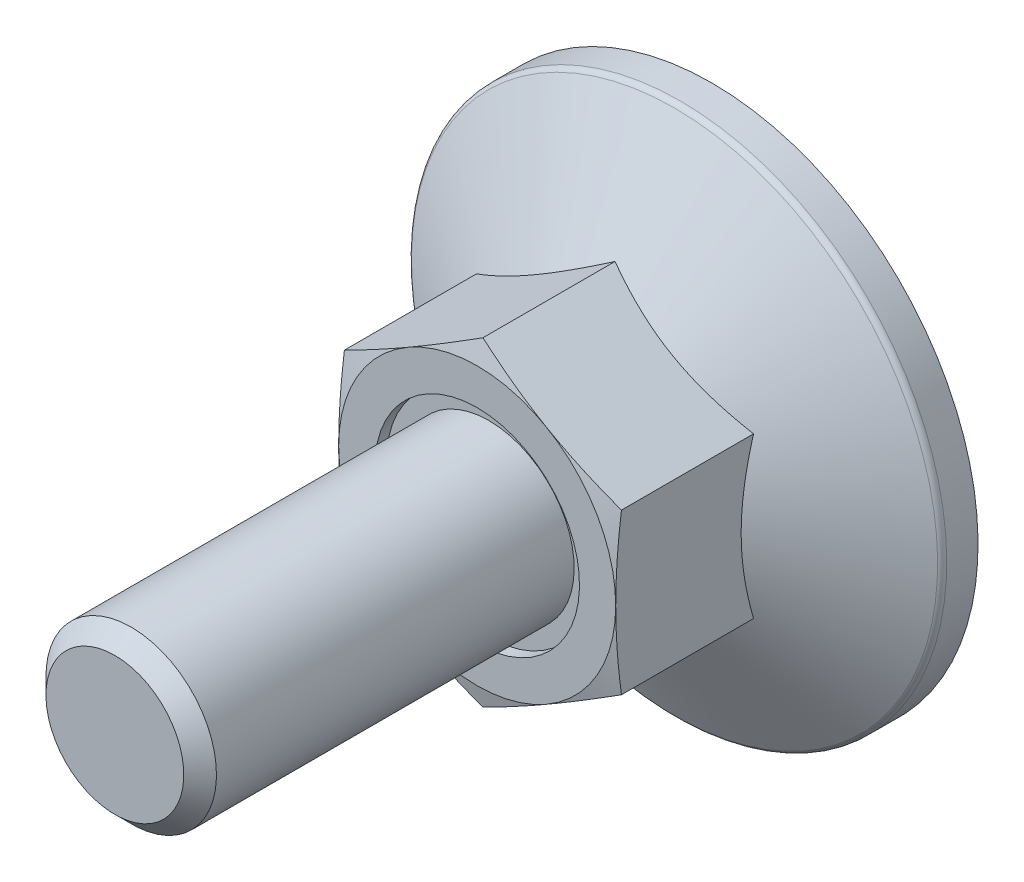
ISO-10303-21;
HEADER;
FILE_DESCRIPTION(('STEP AP214'),'2;1');
FILE_NAME('part.step','',(''),(''),'','','');
FILE_SCHEMA(('AUTOMOTIVE_DESIGN { 1 0 10303 214 1 1 1 1 }'));
ENDSEC;
DATA;
#1=APPLICATION_CONTEXT('core data for automotive mechanical design processes');
#2=APPLICATION_PROTOCOL_DEFINITION('international standard','automotive_design',2000,#1);
#3=PRODUCT_CONTEXT('',#1,'mechanical');
#4=PRODUCT('Part','Part','',(#3));
#5=PRODUCT_RELATED_PRODUCT_CATEGORY('part','',(#4));
#6=PRODUCT_DEFINITION_FORMATION('','',#4);
#7=PRODUCT_DEFINITION_CONTEXT('part definition',#1,'design');
#8=PRODUCT_DEFINITION('design','',#6,#7);
#9=PRODUCT_DEFINITION_SHAPE('','',#8);
#10=(LENGTH_UNIT() NAMED_UNIT(*) SI_UNIT(.MILLI.,.METRE.));
#11=(NAMED_UNIT(*) PLANE_ANGLE_UNIT() SI_UNIT($,.RADIAN.));
#12=(NAMED_UNIT(*) SI_UNIT($,.STERADIAN.) SOLID_ANGLE_UNIT());
#13=UNCERTAINTY_MEASURE_WITH_UNIT(LENGTH_MEASURE(1.E-05),#10,'distance_accuracy_value','');
#14=(GEOMETRIC_REPRESENTATION_CONTEXT(3) GLOBAL_UNCERTAINTY_ASSIGNED_CONTEXT((#13)) GLOBAL_UNIT_ASSIGNED_CONTEXT((#10,
#11,#12)) REPRESENTATION_CONTEXT('',''));
#15=CARTESIAN_POINT('',(0.,0.,0.));
#16=DIRECTION('',(0.,0.,1.));
#17=DIRECTION('',(1.,0.,0.));
#18=AXIS2_PLACEMENT_3D('',#15,#16,#17);
#19=CARTESIAN_POINT('',(0.,0.,10.45));
#20=DIRECTION('',(0.,0.,-1.));
#21=DIRECTION('',(0.,1.,0.));
#22=AXIS2_PLACEMENT_3D('',#19,#20,#21);
#23=PLANE('',#22);
#24=CARTESIAN_POINT('',(0.,0.,10.45));
#25=DIRECTION('',(0.,0.,-1.));
#26=DIRECTION('',(0.,1.,0.));
#27=AXIS2_PLACEMENT_3D('',#24,#25,#26);
#28=CIRCLE('',#27,4.8);
#29=CARTESIAN_POINT('',(0.,4.8,10.45));
#30=VERTEX_POINT('',#29);
#31=EDGE_CURVE('E27',#30,#30,#28,.T.);
#32=ORIENTED_EDGE('',*,*,#31,.F.);
#33=EDGE_LOOP('',(#32));
#34=FACE_BOUND('',#33,.T.);
#35=CARTESIAN_POINT('',(0.,0.,10.45));
#36=DIRECTION('',(0.,0.,-1.));
#37=DIRECTION('',(0.,1.,0.));
#38=AXIS2_PLACEMENT_3D('',#35,#36,#37);
#39=CIRCLE('',#38,4.);
#40=CARTESIAN_POINT('',(0.,4.,10.45));
#41=VERTEX_POINT('',#40);
#42=EDGE_CURVE('E252',#41,#41,#39,.F.);
#43=ORIENTED_EDGE('',*,*,#42,.F.);
#44=EDGE_LOOP('',(#43));
#45=FACE_BOUND('',#44,.T.);
#46=ADVANCED_FACE('F14',(#34,#45),#23,.F.);
#47=CARTESIAN_POINT('',(0.,7.5055534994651,22.));
#48=DIRECTION('',(0.499999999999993,-0.866025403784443,0.));
#49=DIRECTION('',(0.866025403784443,0.499999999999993,0.));
#50=AXIS2_PLACEMENT_3D('',#47,#48,#49);
#51=PLANE('',#50);
#52=CARTESIAN_POINT('',(-6.5002,3.75266127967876,4.53347836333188));
#53=CARTESIAN_POINT('',(-6.35732254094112,3.83515161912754,4.58109719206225));
#54=CARTESIAN_POINT('',(-6.21391236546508,3.91794952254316,4.62655491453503));
#55=CARTESIAN_POINT('',(-5.9259273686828,4.08421773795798,4.71255293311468));
#56=CARTESIAN_POINT('',(-5.78135207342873,4.16768832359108,4.7530911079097));
#57=CARTESIAN_POINT('',(-5.34531134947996,4.41943655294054,4.86653061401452));
#58=CARTESIAN_POINT('',(-5.05212471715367,4.58870793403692,4.93105380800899));
#59=CARTESIAN_POINT('',(-4.61337625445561,4.84201947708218,5.00671503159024));
#60=CARTESIAN_POINT('',(-4.46912536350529,4.92530276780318,5.02826875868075));
#61=CARTESIAN_POINT('',(-4.17997178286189,5.09224566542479,5.06441130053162));
#62=CARTESIAN_POINT('',(-4.03506915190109,5.17590523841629,5.07900073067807));
#63=CARTESIAN_POINT('',(-3.74501222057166,5.34336968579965,5.10084286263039));
#64=CARTESIAN_POINT('',(-3.59985839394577,5.42717428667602,5.10810389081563));
#65=CARTESIAN_POINT('',(-3.30942466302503,5.59485627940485,5.11514131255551));
#66=CARTESIAN_POINT('',(-3.16414476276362,5.67873366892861,5.11491793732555));
#67=CARTESIAN_POINT('',(-2.76612405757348,5.90853103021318,5.1040181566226));
#68=CARTESIAN_POINT('',(-2.51351353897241,6.05437578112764,5.08571979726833));
#69=CARTESIAN_POINT('',(-2.00997032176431,6.34509659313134,5.02769527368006));
#70=CARTESIAN_POINT('',(-1.75903939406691,6.48997163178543,4.9879492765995));
#71=CARTESIAN_POINT('',(-1.25448277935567,6.78127752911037,4.8885957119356));
#72=CARTESIAN_POINT('',(-1.00092075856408,6.92767163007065,4.82856718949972));
#73=CARTESIAN_POINT('',(-0.497578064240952,7.21827667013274,4.69232662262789));
#74=CARTESIAN_POINT('',(-0.247790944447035,7.36249133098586,4.61614658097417));
#75=CARTESIAN_POINT('',(0.000200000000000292,7.50566896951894,4.53347836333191));
#76=B_SPLINE_CURVE_WITH_KNOTS('',3,(#52,#53,#54,#55,#56,#57,#58,#59,#60,#61,#62,#63,#64,#65,#66,
#67,#68,#69,#70,#71,#72,#73,#74,#75),.UNSPECIFIED.,.F.,.F.,(4,2,2,2,2,2,2,2,2,2,2,4),(0.,
0.515105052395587,1.03043143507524,2.06322554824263,2.56697389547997,3.07067772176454,
3.57380860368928,4.07692394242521,4.95279354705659,5.82947446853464,6.72559912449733,
7.61996451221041),.UNSPECIFIED.);
#77=CARTESIAN_POINT('',(-6.5,3.7527767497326,4.53354503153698));
#78=VERTEX_POINT('',#77);
#79=CARTESIAN_POINT('',(0.,7.5055534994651,4.53354503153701));
#80=VERTEX_POINT('',#79);
#81=EDGE_CURVE('E100',#78,#80,#76,.T.);
#82=ORIENTED_EDGE('',*,*,#81,.F.);
#83=DIRECTION('',(0.,0.,-1.));
#84=VECTOR('',#83,1.);
#85=CARTESIAN_POINT('',(-6.5,3.7527767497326,22.));
#86=LINE('',#85,#84);
#87=CARTESIAN_POINT('',(-6.5,3.7527767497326,10.7305627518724));
#88=VERTEX_POINT('',#87);
#89=EDGE_CURVE('E91',#88,#78,#86,.T.);
#90=ORIENTED_EDGE('',*,*,#89,.F.);
#91=CARTESIAN_POINT('',(0.000200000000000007,7.50566896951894,10.7305318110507));
#92=CARTESIAN_POINT('',(-0.269745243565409,7.34981601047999,10.7723102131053));
#93=CARTESIAN_POINT('',(-0.540179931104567,7.19368047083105,10.8102381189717));
#94=CARTESIAN_POINT('',(-1.08200437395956,6.8808579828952,10.876873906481));
#95=CARTESIAN_POINT('',(-1.35339447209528,6.72417083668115,10.9055780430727));
#96=CARTESIAN_POINT('',(-1.89548428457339,6.41119513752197,10.952090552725));
#97=CARTESIAN_POINT('',(-2.16618033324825,6.25490870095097,10.9699543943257));
#98=CARTESIAN_POINT('',(-2.70791763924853,5.94213652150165,10.9939079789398));
#99=CARTESIAN_POINT('',(-2.97895881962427,5.78565082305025,11.));
#100=CARTESIAN_POINT('',(-3.52104118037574,5.47267942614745,11.));
#101=CARTESIAN_POINT('',(-3.79208236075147,5.31619372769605,10.9939079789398));
#102=CARTESIAN_POINT('',(-4.33381966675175,5.00342154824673,10.9699543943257));
#103=CARTESIAN_POINT('',(-4.60451571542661,4.84713511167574,10.952090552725));
#104=CARTESIAN_POINT('',(-5.14660552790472,4.53415941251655,10.9055780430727));
#105=CARTESIAN_POINT('',(-5.41799562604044,4.3774722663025,10.876873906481));
#106=CARTESIAN_POINT('',(-5.95982006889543,4.06464977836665,10.8102381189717));
#107=CARTESIAN_POINT('',(-6.23025475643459,3.90851423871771,10.7723102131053));
#108=CARTESIAN_POINT('',(-6.5002,3.75266127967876,10.7305318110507));
#109=B_SPLINE_CURVE_WITH_KNOTS('',3,(#91,#92,#93,#94,#95,#96,#97,#98,#99,#100,#101,#102,#103,
#104,#105,#106,#107,#108),.UNSPECIFIED.,.F.,.F.,(4,2,2,2,2,2,2,2,4),(0.,0.943529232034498,
1.88744107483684,2.82648138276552,3.76533995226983,4.70419852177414,5.64323882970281,
6.58715067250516,7.53067990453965),.UNSPECIFIED.);
#110=CARTESIAN_POINT('',(-3.24999999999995,5.62916512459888,11.));
#111=VERTEX_POINT('',#110);
#112=EDGE_CURVE('E191',#111,#88,#109,.T.);
#113=ORIENTED_EDGE('',*,*,#112,.F.);
#114=CARTESIAN_POINT('',(0.,7.5055534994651,10.7305627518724));
#115=VERTEX_POINT('',#114);
#116=EDGE_CURVE('E478',#115,#111,#109,.T.);
#117=ORIENTED_EDGE('',*,*,#116,.F.);
#118=DIRECTION('',(0.,0.,-1.));
#119=VECTOR('',#118,1.);
#120=CARTESIAN_POINT('',(0.,7.5055534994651,22.));
#121=LINE('',#120,#119);
#122=EDGE_CURVE('E104',#115,#80,#121,.T.);
#123=ORIENTED_EDGE('',*,*,#122,.T.);
#124=EDGE_LOOP('',(#82,#90,#113,#117,#123));
#125=FACE_BOUND('',#124,.T.);
#126=ADVANCED_FACE('F103',(#125),#51,.F.);
#127=CARTESIAN_POINT('',(6.5,3.7527767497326,22.));
#128=DIRECTION('',(-0.499999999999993,-0.866025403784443,0.));
#129=DIRECTION('',(0.866025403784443,-0.499999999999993,0.));
#130=AXIS2_PLACEMENT_3D('',#127,#128,#129);
#131=PLANE('',#130);
#132=CARTESIAN_POINT('',(-0.0002,7.50566896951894,4.53347836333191));
#133=CARTESIAN_POINT('',(0.142677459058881,7.42317863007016,4.58109719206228));
#134=CARTESIAN_POINT('',(0.286087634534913,7.34038072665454,4.62655491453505));
#135=CARTESIAN_POINT('',(0.574072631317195,7.17411251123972,4.71255293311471));
#136=CARTESIAN_POINT('',(0.718647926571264,7.09064192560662,4.75309110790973));
#137=CARTESIAN_POINT('',(1.15468865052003,6.83889369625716,4.86653061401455));
#138=CARTESIAN_POINT('',(1.44787528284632,6.66962231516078,4.93105380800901));
#139=CARTESIAN_POINT('',(1.88662374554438,6.41631077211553,5.00671503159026));
#140=CARTESIAN_POINT('',(2.03087463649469,6.33302748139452,5.02826875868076));
#141=CARTESIAN_POINT('',(2.32002821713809,6.16608458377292,5.06441130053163));
#142=CARTESIAN_POINT('',(2.46493084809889,6.08242501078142,5.07900073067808));
#143=CARTESIAN_POINT('',(2.75498777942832,5.91496056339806,5.10084286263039));
#144=CARTESIAN_POINT('',(2.90014160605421,5.8311559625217,5.10810389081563));
#145=CARTESIAN_POINT('',(3.19057533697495,5.66347396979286,5.11514131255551));
#146=CARTESIAN_POINT('',(3.33585523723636,5.5795965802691,5.11491793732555));
#147=CARTESIAN_POINT('',(3.73387594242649,5.34979921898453,5.10401815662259));
#148=CARTESIAN_POINT('',(3.98648646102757,5.20395446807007,5.08571979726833));
#149=CARTESIAN_POINT('',(4.49002967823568,4.91323365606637,5.02769527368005));
#150=CARTESIAN_POINT('',(4.74096060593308,4.76835861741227,4.98794927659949));
#151=CARTESIAN_POINT('',(5.24551722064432,4.47705272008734,4.88859571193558));
#152=CARTESIAN_POINT('',(5.49907924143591,4.33065861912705,4.8285671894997));
#153=CARTESIAN_POINT('',(6.00242193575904,4.04005357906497,4.69232662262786));
#154=CARTESIAN_POINT('',(6.25220905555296,3.89583891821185,4.61614658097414));
#155=CARTESIAN_POINT('',(6.5002,3.75266127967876,4.53347836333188));
#156=B_SPLINE_CURVE_WITH_KNOTS('',3,(#132,#133,#134,#135,#136,#137,#138,#139,#140,#141,#142,
#143,#144,#145,#146,#147,#148,#149,#150,#151,#152,#153,#154,#155),.UNSPECIFIED.,.F.,.F.,(4,2,2,
2,2,2,2,2,2,2,2,4),(0.,0.515105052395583,1.03043143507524,2.06322554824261,2.56697389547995,
3.07067772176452,3.57380860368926,4.07692394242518,4.95279354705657,5.82947446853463,
6.72559912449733,7.61996451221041),.UNSPECIFIED.);
#157=CARTESIAN_POINT('',(6.5,3.7527767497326,4.53354503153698));
#158=VERTEX_POINT('',#157);
#159=EDGE_CURVE('E34',#80,#158,#156,.T.);
#160=ORIENTED_EDGE('',*,*,#159,.F.);
#161=ORIENTED_EDGE('',*,*,#122,.F.);
#162=CARTESIAN_POINT('',(6.5002,3.75266127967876,10.7305318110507));
#163=CARTESIAN_POINT('',(6.23025475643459,3.90851423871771,10.7723102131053));
#164=CARTESIAN_POINT('',(5.95982006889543,4.06464977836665,10.8102381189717));
#165=CARTESIAN_POINT('',(5.41799562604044,4.37747226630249,10.876873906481));
#166=CARTESIAN_POINT('',(5.14660552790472,4.53415941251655,10.9055780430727));
#167=CARTESIAN_POINT('',(4.60451571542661,4.84713511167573,10.952090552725));
#168=CARTESIAN_POINT('',(4.33381966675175,5.00342154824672,10.9699543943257));
#169=CARTESIAN_POINT('',(3.79208236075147,5.31619372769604,10.9939079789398));
#170=CARTESIAN_POINT('',(3.52104118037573,5.47267942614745,11.));
#171=CARTESIAN_POINT('',(2.97895881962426,5.78565082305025,11.));
#172=CARTESIAN_POINT('',(2.70791763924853,5.94213652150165,10.9939079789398));
#173=CARTESIAN_POINT('',(2.16618033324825,6.25490870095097,10.9699543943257));
#174=CARTESIAN_POINT('',(1.89548428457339,6.41119513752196,10.952090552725));
#175=CARTESIAN_POINT('',(1.35339447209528,6.72417083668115,10.9055780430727));
#176=CARTESIAN_POINT('',(1.08200437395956,6.8808579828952,10.876873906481));
#177=CARTESIAN_POINT('',(0.540179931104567,7.19368047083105,10.8102381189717));
#178=CARTESIAN_POINT('',(0.26974524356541,7.34981601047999,10.7723102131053));
#179=CARTESIAN_POINT('',(-0.000199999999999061,7.50566896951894,10.7305318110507));
#180=B_SPLINE_CURVE_WITH_KNOTS('',3,(#162,#163,#164,#165,#166,#167,#168,#169,#170,#171,#172,
#173,#174,#175,#176,#177,#178,#179),.UNSPECIFIED.,.F.,.F.,(4,2,2,2,2,2,2,2,4),(0.,
0.943529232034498,1.88744107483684,2.82648138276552,3.76533995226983,4.70419852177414,
5.64323882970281,6.58715067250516,7.53067990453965),.UNSPECIFIED.);
#181=CARTESIAN_POINT('',(3.24999999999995,5.62916512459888,11.));
#182=VERTEX_POINT('',#181);
#183=EDGE_CURVE('E175',#182,#115,#180,.T.);
#184=ORIENTED_EDGE('',*,*,#183,.F.);
#185=CARTESIAN_POINT('',(6.5,3.7527767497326,10.7305627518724));
#186=VERTEX_POINT('',#185);
#187=EDGE_CURVE('E183',#186,#182,#180,.T.);
#188=ORIENTED_EDGE('',*,*,#187,.F.);
#189=DIRECTION('',(0.,0.,-1.));
#190=VECTOR('',#189,1.);
#191=CARTESIAN_POINT('',(6.5,3.7527767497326,22.));
#192=LINE('',#191,#190);
#193=EDGE_CURVE('E481',#186,#158,#192,.T.);
#194=ORIENTED_EDGE('',*,*,#193,.T.);
#195=EDGE_LOOP('',(#160,#161,#184,#188,#194));
#196=FACE_BOUND('',#195,.T.);
#197=ADVANCED_FACE('F165',(#196),#131,.F.);
#198=CARTESIAN_POINT('',(6.5,-3.7527767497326,22.));
#199=DIRECTION('',(-1.,0.,0.));
#200=DIRECTION('',(0.,-1.,0.));
#201=AXIS2_PLACEMENT_3D('',#198,#199,#200);
#202=PLANE('',#201);
#203=CARTESIAN_POINT('',(6.5,10.067414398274,1.94823609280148));
#204=CARTESIAN_POINT('',(6.5,9.78352438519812,2.0858958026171));
#205=CARTESIAN_POINT('',(6.5,9.49898106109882,2.22223138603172));
#206=CARTESIAN_POINT('',(6.5,8.9282401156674,2.49150895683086));
#207=CARTESIAN_POINT('',(6.5,8.64204224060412,2.62445040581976));
#208=CARTESIAN_POINT('',(6.5,8.06616487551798,2.88686541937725));
#209=CARTESIAN_POINT('',(6.5,7.77647490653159,3.01631606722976));
#210=CARTESIAN_POINT('',(6.5,7.19478507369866,3.26989907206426));
#211=CARTESIAN_POINT('',(6.5,6.90278532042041,3.3940316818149));
#212=CARTESIAN_POINT('',(6.5,6.30684739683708,3.6393457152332));
#213=CARTESIAN_POINT('',(6.5,6.00282105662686,3.76031411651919));
#214=CARTESIAN_POINT('',(6.5,5.39120706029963,3.99306391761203));
#215=CARTESIAN_POINT('',(6.5,5.08361900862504,4.10484428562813));
#216=CARTESIAN_POINT('',(6.5,4.46497231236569,4.31627594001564));
#217=CARTESIAN_POINT('',(6.5,4.15392216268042,4.41595183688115));
#218=CARTESIAN_POINT('',(6.5,3.52735818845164,4.59996747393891));
#219=CARTESIAN_POINT('',(6.5,3.21184580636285,4.6843120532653));
#220=CARTESIAN_POINT('',(6.5,2.57783458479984,4.83319256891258));
#221=CARTESIAN_POINT('',(6.5,2.25935972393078,4.8978289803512));
#222=CARTESIAN_POINT('',(6.5,1.61842059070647,5.00357646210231));
#223=CARTESIAN_POINT('',(6.5,1.29595672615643,5.04468991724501));
#224=CARTESIAN_POINT('',(6.5,0.812693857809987,5.08598811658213));
#225=CARTESIAN_POINT('',(6.5,0.652724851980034,5.09635596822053));
#226=CARTESIAN_POINT('',(6.5,0.332484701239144,5.110324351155));
#227=CARTESIAN_POINT('',(6.5,0.172213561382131,5.11392499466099));
#228=CARTESIAN_POINT('',(6.5,-0.148338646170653,5.11426557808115));
#229=CARTESIAN_POINT('',(6.5,-0.308619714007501,5.11100536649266));
#230=CARTESIAN_POINT('',(6.5,-0.628902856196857,5.09770543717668));
#231=CARTESIAN_POINT('',(6.5,-0.788904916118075,5.08766537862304));
#232=CARTESIAN_POINT('',(6.5,-1.1736673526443,5.05558094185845));
#233=CARTESIAN_POINT('',(6.5,-1.39816400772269,5.03030719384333));
#234=CARTESIAN_POINT('',(6.5,-1.84547349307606,4.96779217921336));
#235=CARTESIAN_POINT('',(6.5,-2.06828609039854,4.93054928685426));
#236=CARTESIAN_POINT('',(6.5,-2.73393776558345,4.80284369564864));
#237=CARTESIAN_POINT('',(6.5,-3.17375537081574,4.69642628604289));
#238=CARTESIAN_POINT('',(6.5,-3.83171733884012,4.51203063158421));
#239=CARTESIAN_POINT('',(6.5,-4.0532725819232,4.44552609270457));
#240=CARTESIAN_POINT('',(6.5,-4.49422901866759,4.30565892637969));
#241=CARTESIAN_POINT('',(6.5,-4.7136301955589,4.23229624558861));
#242=CARTESIAN_POINT('',(6.5,-5.15035386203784,4.07988627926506));
#243=CARTESIAN_POINT('',(6.5,-5.36767698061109,4.00084077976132));
#244=CARTESIAN_POINT('',(6.5,-5.800520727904,3.83799065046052));
#245=CARTESIAN_POINT('',(6.5,-6.01604140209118,3.75418614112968));
#246=CARTESIAN_POINT('',(6.5,-6.61842771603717,3.5135303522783));
#247=CARTESIAN_POINT('',(6.5,-7.00350435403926,3.35220459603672));
#248=CARTESIAN_POINT('',(6.5,-7.76959629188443,3.02014813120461));
#249=CARTESIAN_POINT('',(6.5,-8.15061109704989,2.84941629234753));
#250=CARTESIAN_POINT('',(6.5,-8.90957192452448,2.50088582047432));
#251=CARTESIAN_POINT('',(6.5,-9.28751663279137,2.32308433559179));
#252=CARTESIAN_POINT('',(6.5,-10.0408394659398,1.96218611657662));
#253=CARTESIAN_POINT('',(6.5,-10.4162177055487,1.77908962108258));
#254=CARTESIAN_POINT('',(6.5,-11.1655631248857,1.40849620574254));
#255=CARTESIAN_POINT('',(6.5,-11.5395269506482,1.22099251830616));
#256=CARTESIAN_POINT('',(6.5,-12.2858210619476,0.842758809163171));
#257=CARTESIAN_POINT('',(6.5,-12.6581513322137,0.652028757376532));
#258=CARTESIAN_POINT('',(6.5,-13.4013949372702,0.268043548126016));
#259=CARTESIAN_POINT('',(6.5,-13.7723085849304,0.0747889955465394));
#260=CARTESIAN_POINT('',(6.5,-14.5130449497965,-0.313800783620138));
#261=CARTESIAN_POINT('',(6.5,-14.8828676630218,-0.509136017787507));
#262=CARTESIAN_POINT('',(6.5,-15.9085714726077,-1.05391022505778));
#263=CARTESIAN_POINT('',(6.5,-16.5634819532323,-1.40517623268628));
#264=CARTESIAN_POINT('',(6.5,-17.871267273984,-2.11157255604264));
#265=CARTESIAN_POINT('',(6.5,-18.5241419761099,-2.46670312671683));
#266=CARTESIAN_POINT('',(6.5,-19.8261496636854,-3.17862531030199));
#267=CARTESIAN_POINT('',(6.5,-20.4752878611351,-3.53540739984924));
#268=CARTESIAN_POINT('',(6.5,-21.7722968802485,-4.25114422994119));
#269=CARTESIAN_POINT('',(6.5,-22.4201678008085,-4.61009879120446));
#270=CARTESIAN_POINT('',(6.5,-23.0675997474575,-4.9698379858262));
#271=B_SPLINE_CURVE_WITH_KNOTS('',3,(#203,#204,#205,#206,#207,#208,#209,#210,#211,#212,#213,
#214,#215,#216,#217,#218,#219,#220,#221,#222,#223,#224,#225,#226,#227,#228,#229,#230,#231,#232,
#233,#234,#235,#236,#237,#238,#239,#240,#241,#242,#243,#244,#245,#246,#247,#248,#249,#250,#251,
#252,#253,#254,#255,#256,#257,#258,#259,#260,#261,#262,#263,#264,#265,#266,#267,#268,#269,#270),
.UNSPECIFIED.,.F.,.F.,(4,2,2,2,2,2,2,2,2,2,2,2,2,2,2,2,2,2,2,2,2,2,2,2,2,2,2,2,2,2,2,2,2,4),(0.,
0.94652822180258,1.89320566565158,2.84505559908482,3.79686024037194,4.77837094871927,
5.75999172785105,6.73958204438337,7.71886262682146,8.69306383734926,9.66716626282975,
10.1479587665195,10.6287432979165,11.1095384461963,11.5903577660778,12.267719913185,
12.9451741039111,14.3007885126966,14.9946950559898,15.6886069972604,16.3823017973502,
17.0759790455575,18.3282990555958,19.5807698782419,20.8337511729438,22.086676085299,
23.3416700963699,24.5966758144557,25.8513861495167,27.1061010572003,29.3355785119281,
31.5652039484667,33.7873748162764,36.0093647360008),.UNSPECIFIED.);
#272=CARTESIAN_POINT('',(6.5,-3.7527767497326,4.53354503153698));
#273=VERTEX_POINT('',#272);
#274=EDGE_CURVE('E42',#158,#273,#271,.T.);
#275=ORIENTED_EDGE('',*,*,#274,.F.);
#276=ORIENTED_EDGE('',*,*,#193,.F.);
#277=CARTESIAN_POINT('',(6.5,9.92747995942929,9.56215186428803));
#278=CARTESIAN_POINT('',(6.5,9.63259364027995,9.62823955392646));
#279=CARTESIAN_POINT('',(6.5,9.33752287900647,9.69351898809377));
#280=CARTESIAN_POINT('',(6.5,8.74692189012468,9.82202506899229));
#281=CARTESIAN_POINT('',(6.5,8.45139164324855,9.88525162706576));
#282=CARTESIAN_POINT('',(6.5,7.85951636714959,10.0092707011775));
#283=CARTESIAN_POINT('',(6.5,7.56317082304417,10.0700607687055));
#284=CARTESIAN_POINT('',(6.5,6.9698629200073,10.1885506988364));
#285=CARTESIAN_POINT('',(6.5,6.67290056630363,10.2462505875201));
#286=CARTESIAN_POINT('',(6.5,6.08062010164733,10.3573796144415));
#287=CARTESIAN_POINT('',(6.5,5.78530770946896,10.410839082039));
#288=CARTESIAN_POINT('',(6.5,5.19387740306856,10.5130907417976));
#289=CARTESIAN_POINT('',(6.5,4.89775950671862,10.5618830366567));
#290=CARTESIAN_POINT('',(6.5,4.30466070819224,10.6537017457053));
#291=CARTESIAN_POINT('',(6.5,4.00767991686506,10.69672886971));
#292=CARTESIAN_POINT('',(6.5,3.41277328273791,10.7757492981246));
#293=CARTESIAN_POINT('',(6.5,3.11484743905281,10.8117425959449));
#294=CARTESIAN_POINT('',(6.5,2.51468954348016,10.8756761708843));
#295=CARTESIAN_POINT('',(6.5,2.21244707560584,10.9035201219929));
#296=CARTESIAN_POINT('',(6.5,1.60720229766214,10.9492341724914));
#297=CARTESIAN_POINT('',(6.5,1.30420000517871,10.9671045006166));
#298=CARTESIAN_POINT('',(6.5,0.697875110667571,10.9918290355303));
#299=CARTESIAN_POINT('',(6.5,0.394552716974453,10.9986882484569));
#300=CARTESIAN_POINT('',(6.5,-0.212135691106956,11.0009688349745));
#301=CARTESIAN_POINT('',(6.5,-0.515501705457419,10.9963902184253));
#302=CARTESIAN_POINT('',(6.5,-1.1229550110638,10.9760526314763));
#303=CARTESIAN_POINT('',(6.5,-1.42704091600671,10.9602530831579));
#304=CARTESIAN_POINT('',(6.5,-2.03449758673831,10.918375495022));
#305=CARTESIAN_POINT('',(6.5,-2.33786833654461,10.892297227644));
#306=CARTESIAN_POINT('',(6.5,-2.94389214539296,10.8311794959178));
#307=CARTESIAN_POINT('',(6.5,-3.24654460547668,10.7961341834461));
#308=CARTESIAN_POINT('',(6.5,-3.85087551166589,10.7185406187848));
#309=CARTESIAN_POINT('',(6.5,-4.15255395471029,10.6759923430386));
#310=CARTESIAN_POINT('',(6.5,-4.73502363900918,10.5877746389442));
#311=CARTESIAN_POINT('',(6.5,-5.01587505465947,10.5424985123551));
#312=CARTESIAN_POINT('',(6.5,-5.57683763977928,10.4475514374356));
#313=CARTESIAN_POINT('',(6.5,-5.85694878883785,10.3978803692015));
#314=CARTESIAN_POINT('',(6.5,-6.41653333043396,10.2949474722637));
#315=CARTESIAN_POINT('',(6.5,-6.69600666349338,10.2416853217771));
#316=CARTESIAN_POINT('',(6.5,-7.25437933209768,10.132225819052));
#317=CARTESIAN_POINT('',(6.5,-7.53327866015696,10.0760284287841));
#318=CARTESIAN_POINT('',(6.5,-8.36936246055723,9.90383082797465));
#319=CARTESIAN_POINT('',(6.5,-8.9258084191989,9.78424858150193));
#320=CARTESIAN_POINT('',(6.5,-10.0372205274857,9.53861051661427));
#321=CARTESIAN_POINT('',(6.5,-10.5921867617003,9.41255507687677));
#322=CARTESIAN_POINT('',(6.5,-11.6956125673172,9.15714489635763));
#323=CARTESIAN_POINT('',(6.5,-12.244082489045,9.02783474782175));
#324=CARTESIAN_POINT('',(6.5,-13.3402571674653,8.76597711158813));
#325=CARTESIAN_POINT('',(6.5,-13.8879619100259,8.6334295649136));
#326=CARTESIAN_POINT('',(6.5,-14.9821103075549,8.36610757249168));
#327=CARTESIAN_POINT('',(6.5,-15.528554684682,8.23133607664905));
#328=CARTESIAN_POINT('',(6.5,-16.6209674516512,7.95995280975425));
#329=CARTESIAN_POINT('',(6.5,-17.1669358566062,7.82334109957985));
#330=CARTESIAN_POINT('',(6.5,-17.7127383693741,7.6860776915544));
#331=B_SPLINE_CURVE_WITH_KNOTS('',3,(#277,#278,#279,#280,#281,#282,#283,#284,#285,#286,#287,
#288,#289,#290,#291,#292,#293,#294,#295,#296,#297,#298,#299,#300,#301,#302,#303,#304,#305,#306,
#307,#308,#309,#310,#311,#312,#313,#314,#315,#316,#317,#318,#319,#320,#321,#322,#323,#324,#325,
#326,#327,#328,#329,#330),.UNSPECIFIED.,.F.,.F.,(4,2,2,2,2,2,2,2,2,2,2,2,2,2,2,2,2,2,2,2,2,2,2,
2,2,2,4),(0.,0.906607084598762,1.8132532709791,2.72078883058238,3.62831672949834,
4.52862337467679,5.42891020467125,6.32908608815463,7.22926281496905,8.13968571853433,
9.05008774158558,9.96007573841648,10.8700629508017,11.7833577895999,12.6966728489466,
13.6105850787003,14.5245001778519,15.3778915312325,16.2313061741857,17.084797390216,
17.9382996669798,19.6456836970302,21.3529679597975,23.0434756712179,24.7340142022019,
26.4224665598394,28.1108631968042),.UNSPECIFIED.);
#332=CARTESIAN_POINT('',(6.5,0.,11.));
#333=VERTEX_POINT('',#332);
#334=EDGE_CURVE('E185',#333,#186,#331,.F.);
#335=ORIENTED_EDGE('',*,*,#334,.F.);
#336=CARTESIAN_POINT('',(6.5,-3.7527767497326,10.7305627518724));
#337=VERTEX_POINT('',#336);
#338=EDGE_CURVE('E184',#337,#333,#331,.F.);
#339=ORIENTED_EDGE('',*,*,#338,.F.);
#340=DIRECTION('',(0.,0.,-1.));
#341=VECTOR('',#340,1.);
#342=CARTESIAN_POINT('',(6.5,-3.7527767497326,22.));
#343=LINE('',#342,#341);
#344=EDGE_CURVE('E453',#337,#273,#343,.T.);
#345=ORIENTED_EDGE('',*,*,#344,.T.);
#346=EDGE_LOOP('',(#275,#276,#335,#339,#345));
#347=FACE_BOUND('',#346,.T.);
#348=ADVANCED_FACE('F169',(#347),#202,.F.);
#349=CARTESIAN_POINT('',(0.,-7.5055534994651,22.));
#350=DIRECTION('',(-0.499999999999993,0.866025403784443,0.));
#351=DIRECTION('',(-0.866025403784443,-0.499999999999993,0.));
#352=AXIS2_PLACEMENT_3D('',#349,#350,#351);
#353=PLANE('',#352);
#354=CARTESIAN_POINT('',(6.5002,-3.75266127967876,4.53347836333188));
#355=CARTESIAN_POINT('',(6.35732254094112,-3.83515161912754,4.58109719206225));
#356=CARTESIAN_POINT('',(6.21391236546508,-3.91794952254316,4.62655491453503));
#357=CARTESIAN_POINT('',(5.9259273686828,-4.08421773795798,4.71255293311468));
#358=CARTESIAN_POINT('',(5.78135207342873,-4.16768832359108,4.7530911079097));
#359=CARTESIAN_POINT('',(5.34531134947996,-4.41943655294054,4.86653061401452));
#360=CARTESIAN_POINT('',(5.05212471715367,-4.58870793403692,4.93105380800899));
#361=CARTESIAN_POINT('',(4.61337625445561,-4.84201947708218,5.00671503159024));
#362=CARTESIAN_POINT('',(4.46912536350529,-4.92530276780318,5.02826875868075));
#363=CARTESIAN_POINT('',(4.17997178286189,-5.09224566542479,5.06441130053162));
#364=CARTESIAN_POINT('',(4.03506915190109,-5.17590523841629,5.07900073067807));
#365=CARTESIAN_POINT('',(3.74501222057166,-5.34336968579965,5.10084286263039));
#366=CARTESIAN_POINT('',(3.59985839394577,-5.42717428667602,5.10810389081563));
#367=CARTESIAN_POINT('',(3.30942466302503,-5.59485627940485,5.11514131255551));
#368=CARTESIAN_POINT('',(3.16414476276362,-5.67873366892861,5.11491793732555));
#369=CARTESIAN_POINT('',(2.76612405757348,-5.90853103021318,5.1040181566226));
#370=CARTESIAN_POINT('',(2.51351353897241,-6.05437578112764,5.08571979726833));
#371=CARTESIAN_POINT('',(2.00997032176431,-6.34509659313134,5.02769527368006));
#372=CARTESIAN_POINT('',(1.75903939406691,-6.48997163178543,4.9879492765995));
#373=CARTESIAN_POINT('',(1.25448277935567,-6.78127752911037,4.8885957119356));
#374=CARTESIAN_POINT('',(1.00092075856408,-6.92767163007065,4.82856718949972));
#375=CARTESIAN_POINT('',(0.497578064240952,-7.21827667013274,4.69232662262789));
#376=CARTESIAN_POINT('',(0.247790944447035,-7.36249133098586,4.61614658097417));
#377=CARTESIAN_POINT('',(-0.000200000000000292,-7.50566896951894,4.53347836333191));
#378=B_SPLINE_CURVE_WITH_KNOTS('',3,(#354,#355,#356,#357,#358,#359,#360,#361,#362,#363,#364,
#365,#366,#367,#368,#369,#370,#371,#372,#373,#374,#375,#376,#377),.UNSPECIFIED.,.F.,.F.,(4,2,2,
2,2,2,2,2,2,2,2,4),(0.,0.515105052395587,1.03043143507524,2.06322554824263,2.56697389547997,
3.07067772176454,3.57380860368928,4.07692394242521,4.95279354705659,5.82947446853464,
6.72559912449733,7.61996451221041),.UNSPECIFIED.);
#379=CARTESIAN_POINT('',(0.,-7.5055534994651,4.53354503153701));
#380=VERTEX_POINT('',#379);
#381=EDGE_CURVE('E112',#273,#380,#378,.T.);
#382=ORIENTED_EDGE('',*,*,#381,.F.);
#383=ORIENTED_EDGE('',*,*,#344,.F.);
#384=CARTESIAN_POINT('',(-0.000200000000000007,-7.50566896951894,10.7305318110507));
#385=CARTESIAN_POINT('',(0.269745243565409,-7.34981601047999,10.7723102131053));
#386=CARTESIAN_POINT('',(0.540179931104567,-7.19368047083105,10.8102381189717));
#387=CARTESIAN_POINT('',(1.08200437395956,-6.8808579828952,10.876873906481));
#388=CARTESIAN_POINT('',(1.35339447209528,-6.72417083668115,10.9055780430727));
#389=CARTESIAN_POINT('',(1.89548428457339,-6.41119513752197,10.952090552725));
#390=CARTESIAN_POINT('',(2.16618033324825,-6.25490870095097,10.9699543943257));
#391=CARTESIAN_POINT('',(2.70791763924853,-5.94213652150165,10.9939079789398));
#392=CARTESIAN_POINT('',(2.97895881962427,-5.78565082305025,11.));
#393=CARTESIAN_POINT('',(3.52104118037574,-5.47267942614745,11.));
#394=CARTESIAN_POINT('',(3.79208236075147,-5.31619372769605,10.9939079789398));
#395=CARTESIAN_POINT('',(4.33381966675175,-5.00342154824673,10.9699543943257));
#396=CARTESIAN_POINT('',(4.60451571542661,-4.84713511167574,10.952090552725));
#397=CARTESIAN_POINT('',(5.14660552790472,-4.53415941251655,10.9055780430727));
#398=CARTESIAN_POINT('',(5.41799562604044,-4.3774722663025,10.876873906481));
#399=CARTESIAN_POINT('',(5.95982006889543,-4.06464977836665,10.8102381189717));
#400=CARTESIAN_POINT('',(6.23025475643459,-3.90851423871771,10.7723102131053));
#401=CARTESIAN_POINT('',(6.5002,-3.75266127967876,10.7305318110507));
#402=B_SPLINE_CURVE_WITH_KNOTS('',3,(#384,#385,#386,#387,#388,#389,#390,#391,#392,#393,#394,
#395,#396,#397,#398,#399,#400,#401),.UNSPECIFIED.,.F.,.F.,(4,2,2,2,2,2,2,2,4),(0.,
0.943529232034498,1.88744107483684,2.82648138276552,3.76533995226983,4.70419852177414,
5.64323882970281,6.58715067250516,7.53067990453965),.UNSPECIFIED.);
#403=CARTESIAN_POINT('',(3.24999999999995,-5.62916512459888,11.));
#404=VERTEX_POINT('',#403);
#405=EDGE_CURVE('E222',#404,#337,#402,.T.);
#406=ORIENTED_EDGE('',*,*,#405,.F.);
#407=CARTESIAN_POINT('',(0.,-7.5055534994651,10.7305627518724));
#408=VERTEX_POINT('',#407);
#409=EDGE_CURVE('E228',#408,#404,#402,.T.);
#410=ORIENTED_EDGE('',*,*,#409,.F.);
#411=DIRECTION('',(0.,0.,-1.));
#412=VECTOR('',#411,1.);
#413=CARTESIAN_POINT('',(0.,-7.5055534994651,22.));
#414=LINE('',#413,#412);
#415=EDGE_CURVE('E483',#408,#380,#414,.T.);
#416=ORIENTED_EDGE('',*,*,#415,.T.);
#417=EDGE_LOOP('',(#382,#383,#406,#410,#416));
#418=FACE_BOUND('',#417,.T.);
#419=ADVANCED_FACE('F230',(#418),#353,.F.);
#420=CARTESIAN_POINT('',(-6.5,-3.7527767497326,22.));
#421=DIRECTION('',(0.499999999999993,0.866025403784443,0.));
#422=DIRECTION('',(-0.866025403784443,0.499999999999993,0.));
#423=AXIS2_PLACEMENT_3D('',#420,#421,#422);
#424=PLANE('',#423);
#425=CARTESIAN_POINT('',(0.0002,-7.50566896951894,4.53347836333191));
#426=CARTESIAN_POINT('',(-0.142677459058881,-7.42317863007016,4.58109719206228));
#427=CARTESIAN_POINT('',(-0.286087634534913,-7.34038072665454,4.62655491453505));
#428=CARTESIAN_POINT('',(-0.574072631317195,-7.17411251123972,4.71255293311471));
#429=CARTESIAN_POINT('',(-0.718647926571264,-7.09064192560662,4.75309110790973));
#430=CARTESIAN_POINT('',(-1.15468865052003,-6.83889369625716,4.86653061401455));
#431=CARTESIAN_POINT('',(-1.44787528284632,-6.66962231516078,4.93105380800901));
#432=CARTESIAN_POINT('',(-1.88662374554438,-6.41631077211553,5.00671503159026));
#433=CARTESIAN_POINT('',(-2.03087463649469,-6.33302748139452,5.02826875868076));
#434=CARTESIAN_POINT('',(-2.32002821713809,-6.16608458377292,5.06441130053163));
#435=CARTESIAN_POINT('',(-2.46493084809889,-6.08242501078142,5.07900073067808));
#436=CARTESIAN_POINT('',(-2.75498777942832,-5.91496056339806,5.10084286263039));
#437=CARTESIAN_POINT('',(-2.90014160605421,-5.8311559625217,5.10810389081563));
#438=CARTESIAN_POINT('',(-3.19057533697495,-5.66347396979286,5.11514131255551));
#439=CARTESIAN_POINT('',(-3.33585523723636,-5.5795965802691,5.11491793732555));
#440=CARTESIAN_POINT('',(-3.73387594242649,-5.34979921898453,5.10401815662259));
#441=CARTESIAN_POINT('',(-3.98648646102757,-5.20395446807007,5.08571979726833));
#442=CARTESIAN_POINT('',(-4.49002967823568,-4.91323365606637,5.02769527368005));
#443=CARTESIAN_POINT('',(-4.74096060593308,-4.76835861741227,4.98794927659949));
#444=CARTESIAN_POINT('',(-5.24551722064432,-4.47705272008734,4.88859571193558));
#445=CARTESIAN_POINT('',(-5.49907924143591,-4.33065861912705,4.8285671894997));
#446=CARTESIAN_POINT('',(-6.00242193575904,-4.04005357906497,4.69232662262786));
#447=CARTESIAN_POINT('',(-6.25220905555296,-3.89583891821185,4.61614658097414));
#448=CARTESIAN_POINT('',(-6.5002,-3.75266127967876,4.53347836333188));
#449=B_SPLINE_CURVE_WITH_KNOTS('',3,(#425,#426,#427,#428,#429,#430,#431,#432,#433,#434,#435,
#436,#437,#438,#439,#440,#441,#442,#443,#444,#445,#446,#447,#448),.UNSPECIFIED.,.F.,.F.,(4,2,2,
2,2,2,2,2,2,2,2,4),(0.,0.515105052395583,1.03043143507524,2.06322554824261,2.56697389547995,
3.07067772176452,3.57380860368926,4.07692394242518,4.95279354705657,5.82947446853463,
6.72559912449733,7.61996451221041),.UNSPECIFIED.);
#450=CARTESIAN_POINT('',(-6.5,-3.7527767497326,4.53354503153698));
#451=VERTEX_POINT('',#450);
#452=EDGE_CURVE('E110',#380,#451,#449,.T.);
#453=ORIENTED_EDGE('',*,*,#452,.F.);
#454=ORIENTED_EDGE('',*,*,#415,.F.);
#455=CARTESIAN_POINT('',(-6.5002,-3.75266127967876,10.7305318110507));
#456=CARTESIAN_POINT('',(-6.23025475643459,-3.90851423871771,10.7723102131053));
#457=CARTESIAN_POINT('',(-5.95982006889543,-4.06464977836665,10.8102381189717));
#458=CARTESIAN_POINT('',(-5.41799562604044,-4.37747226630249,10.876873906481));
#459=CARTESIAN_POINT('',(-5.14660552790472,-4.53415941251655,10.9055780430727));
#460=CARTESIAN_POINT('',(-4.60451571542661,-4.84713511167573,10.952090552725));
#461=CARTESIAN_POINT('',(-4.33381966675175,-5.00342154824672,10.9699543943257));
#462=CARTESIAN_POINT('',(-3.79208236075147,-5.31619372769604,10.9939079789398));
#463=CARTESIAN_POINT('',(-3.52104118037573,-5.47267942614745,11.));
#464=CARTESIAN_POINT('',(-2.97895881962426,-5.78565082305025,11.));
#465=CARTESIAN_POINT('',(-2.70791763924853,-5.94213652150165,10.9939079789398));
#466=CARTESIAN_POINT('',(-2.16618033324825,-6.25490870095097,10.9699543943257));
#467=CARTESIAN_POINT('',(-1.89548428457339,-6.41119513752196,10.952090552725));
#468=CARTESIAN_POINT('',(-1.35339447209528,-6.72417083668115,10.9055780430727));
#469=CARTESIAN_POINT('',(-1.08200437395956,-6.8808579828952,10.876873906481));
#470=CARTESIAN_POINT('',(-0.540179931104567,-7.19368047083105,10.8102381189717));
#471=CARTESIAN_POINT('',(-0.26974524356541,-7.34981601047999,10.7723102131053));
#472=CARTESIAN_POINT('',(0.000199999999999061,-7.50566896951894,10.7305318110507));
#473=B_SPLINE_CURVE_WITH_KNOTS('',3,(#455,#456,#457,#458,#459,#460,#461,#462,#463,#464,#465,
#466,#467,#468,#469,#470,#471,#472),.UNSPECIFIED.,.F.,.F.,(4,2,2,2,2,2,2,2,4),(0.,
0.943529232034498,1.88744107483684,2.82648138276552,3.76533995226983,4.70419852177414,
5.64323882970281,6.58715067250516,7.53067990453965),.UNSPECIFIED.);
#474=CARTESIAN_POINT('',(-3.24999999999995,-5.62916512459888,11.));
#475=VERTEX_POINT('',#474);
#476=EDGE_CURVE('E216',#475,#408,#473,.T.);
#477=ORIENTED_EDGE('',*,*,#476,.F.);
#478=CARTESIAN_POINT('',(-6.5,-3.7527767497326,10.7305627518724));
#479=VERTEX_POINT('',#478);
#480=EDGE_CURVE('E229',#479,#475,#473,.T.);
#481=ORIENTED_EDGE('',*,*,#480,.F.);
#482=DIRECTION('',(0.,0.,-1.));
#483=VECTOR('',#482,1.);
#484=CARTESIAN_POINT('',(-6.5,-3.7527767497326,22.));
#485=LINE('',#484,#483);
#486=EDGE_CURVE('E99',#479,#451,#485,.T.);
#487=ORIENTED_EDGE('',*,*,#486,.T.);
#488=EDGE_LOOP('',(#453,#454,#477,#481,#487));
#489=FACE_BOUND('',#488,.T.);
#490=ADVANCED_FACE('F134',(#489),#424,.F.);
#491=CARTESIAN_POINT('',(-6.5,3.7527767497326,22.));
#492=DIRECTION('',(1.,0.,0.));
#493=DIRECTION('',(0.,1.,0.));
#494=AXIS2_PLACEMENT_3D('',#491,#492,#493);
#495=PLANE('',#494);
#496=CARTESIAN_POINT('',(-6.5,10.067414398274,1.94823609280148));
#497=CARTESIAN_POINT('',(-6.5,9.78352438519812,2.0858958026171));
#498=CARTESIAN_POINT('',(-6.5,9.49898106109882,2.22223138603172));
#499=CARTESIAN_POINT('',(-6.5,8.9282401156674,2.49150895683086));
#500=CARTESIAN_POINT('',(-6.5,8.64204224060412,2.62445040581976));
#501=CARTESIAN_POINT('',(-6.5,8.06616487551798,2.88686541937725));
#502=CARTESIAN_POINT('',(-6.5,7.77647490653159,3.01631606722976));
#503=CARTESIAN_POINT('',(-6.5,7.19478507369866,3.26989907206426));
#504=CARTESIAN_POINT('',(-6.5,6.90278532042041,3.3940316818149));
#505=CARTESIAN_POINT('',(-6.5,6.30684739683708,3.6393457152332));
#506=CARTESIAN_POINT('',(-6.5,6.00282105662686,3.76031411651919));
#507=CARTESIAN_POINT('',(-6.5,5.39120706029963,3.99306391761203));
#508=CARTESIAN_POINT('',(-6.5,5.08361900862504,4.10484428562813));
#509=CARTESIAN_POINT('',(-6.5,4.46497231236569,4.31627594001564));
#510=CARTESIAN_POINT('',(-6.5,4.15392216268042,4.41595183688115));
#511=CARTESIAN_POINT('',(-6.5,3.52735818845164,4.59996747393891));
#512=CARTESIAN_POINT('',(-6.5,3.21184580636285,4.6843120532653));
#513=CARTESIAN_POINT('',(-6.5,2.57783458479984,4.83319256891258));
#514=CARTESIAN_POINT('',(-6.5,2.25935972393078,4.8978289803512));
#515=CARTESIAN_POINT('',(-6.5,1.61842059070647,5.00357646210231));
#516=CARTESIAN_POINT('',(-6.5,1.29595672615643,5.04468991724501));
#517=CARTESIAN_POINT('',(-6.5,0.812693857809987,5.08598811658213));
#518=CARTESIAN_POINT('',(-6.5,0.652724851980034,5.09635596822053));
#519=CARTESIAN_POINT('',(-6.5,0.332484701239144,5.110324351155));
#520=CARTESIAN_POINT('',(-6.5,0.172213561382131,5.11392499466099));
#521=CARTESIAN_POINT('',(-6.5,-0.148338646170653,5.11426557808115));
#522=CARTESIAN_POINT('',(-6.5,-0.308619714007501,5.11100536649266));
#523=CARTESIAN_POINT('',(-6.5,-0.628902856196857,5.09770543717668));
#524=CARTESIAN_POINT('',(-6.5,-0.788904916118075,5.08766537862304));
#525=CARTESIAN_POINT('',(-6.5,-1.1736673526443,5.05558094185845));
#526=CARTESIAN_POINT('',(-6.5,-1.39816400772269,5.03030719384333));
#527=CARTESIAN_POINT('',(-6.5,-1.84547349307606,4.96779217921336));
#528=CARTESIAN_POINT('',(-6.5,-2.06828609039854,4.93054928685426));
#529=CARTESIAN_POINT('',(-6.5,-2.73393776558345,4.80284369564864));
#530=CARTESIAN_POINT('',(-6.5,-3.17375537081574,4.69642628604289));
#531=CARTESIAN_POINT('',(-6.5,-3.83171733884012,4.51203063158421));
#532=CARTESIAN_POINT('',(-6.5,-4.0532725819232,4.44552609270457));
#533=CARTESIAN_POINT('',(-6.5,-4.49422901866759,4.30565892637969));
#534=CARTESIAN_POINT('',(-6.5,-4.7136301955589,4.23229624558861));
#535=CARTESIAN_POINT('',(-6.5,-5.15035386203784,4.07988627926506));
#536=CARTESIAN_POINT('',(-6.5,-5.36767698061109,4.00084077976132));
#537=CARTESIAN_POINT('',(-6.5,-5.800520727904,3.83799065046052));
#538=CARTESIAN_POINT('',(-6.5,-6.01604140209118,3.75418614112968));
#539=CARTESIAN_POINT('',(-6.5,-6.61842771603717,3.5135303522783));
#540=CARTESIAN_POINT('',(-6.5,-7.00350435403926,3.35220459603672));
#541=CARTESIAN_POINT('',(-6.5,-7.76959629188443,3.02014813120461));
#542=CARTESIAN_POINT('',(-6.5,-8.15061109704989,2.84941629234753));
#543=CARTESIAN_POINT('',(-6.5,-8.90957192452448,2.50088582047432));
#544=CARTESIAN_POINT('',(-6.5,-9.28751663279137,2.32308433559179));
#545=CARTESIAN_POINT('',(-6.5,-10.0408394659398,1.96218611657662));
#546=CARTESIAN_POINT('',(-6.5,-10.4162177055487,1.77908962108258));
#547=CARTESIAN_POINT('',(-6.5,-11.1655631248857,1.40849620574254));
#548=CARTESIAN_POINT('',(-6.5,-11.5395269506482,1.22099251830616));
#549=CARTESIAN_POINT('',(-6.5,-12.2858210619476,0.842758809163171));
#550=CARTESIAN_POINT('',(-6.5,-12.6581513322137,0.652028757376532));
#551=CARTESIAN_POINT('',(-6.5,-13.4013949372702,0.268043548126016));
#552=CARTESIAN_POINT('',(-6.5,-13.7723085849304,0.0747889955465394));
#553=CARTESIAN_POINT('',(-6.5,-14.5130449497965,-0.313800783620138));
#554=CARTESIAN_POINT('',(-6.5,-14.8828676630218,-0.509136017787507));
#555=CARTESIAN_POINT('',(-6.5,-15.9085714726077,-1.05391022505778));
#556=CARTESIAN_POINT('',(-6.5,-16.5634819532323,-1.40517623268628));
#557=CARTESIAN_POINT('',(-6.5,-17.871267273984,-2.11157255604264));
#558=CARTESIAN_POINT('',(-6.5,-18.5241419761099,-2.46670312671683));
#559=CARTESIAN_POINT('',(-6.5,-19.8261496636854,-3.17862531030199));
#560=CARTESIAN_POINT('',(-6.5,-20.4752878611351,-3.53540739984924));
#561=CARTESIAN_POINT('',(-6.5,-21.7722968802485,-4.25114422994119));
#562=CARTESIAN_POINT('',(-6.5,-22.4201678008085,-4.61009879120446));
#563=CARTESIAN_POINT('',(-6.5,-23.0675997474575,-4.9698379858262));
#564=B_SPLINE_CURVE_WITH_KNOTS('',3,(#496,#497,#498,#499,#500,#501,#502,#503,#504,#505,#506,
#507,#508,#509,#510,#511,#512,#513,#514,#515,#516,#517,#518,#519,#520,#521,#522,#523,#524,#525,
#526,#527,#528,#529,#530,#531,#532,#533,#534,#535,#536,#537,#538,#539,#540,#541,#542,#543,#544,
#545,#546,#547,#548,#549,#550,#551,#552,#553,#554,#555,#556,#557,#558,#559,#560,#561,#562,#563),
.UNSPECIFIED.,.F.,.F.,(4,2,2,2,2,2,2,2,2,2,2,2,2,2,2,2,2,2,2,2,2,2,2,2,2,2,2,2,2,2,2,2,2,4),(0.,
0.94652822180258,1.89320566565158,2.84505559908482,3.79686024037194,4.77837094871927,
5.75999172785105,6.73958204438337,7.71886262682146,8.69306383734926,9.66716626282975,
10.1479587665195,10.6287432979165,11.1095384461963,11.5903577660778,12.267719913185,
12.9451741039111,14.3007885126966,14.9946950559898,15.6886069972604,16.3823017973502,
17.0759790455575,18.3282990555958,19.5807698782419,20.8337511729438,22.086676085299,
23.3416700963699,24.5966758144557,25.8513861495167,27.1061010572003,29.3355785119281,
31.5652039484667,33.7873748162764,36.0093647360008),.UNSPECIFIED.);
#565=EDGE_CURVE('E9',#451,#78,#564,.F.);
#566=ORIENTED_EDGE('',*,*,#565,.F.);
#567=ORIENTED_EDGE('',*,*,#486,.F.);
#568=CARTESIAN_POINT('',(-6.5,9.92747995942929,9.56215186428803));
#569=CARTESIAN_POINT('',(-6.5,9.63259364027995,9.62823955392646));
#570=CARTESIAN_POINT('',(-6.5,9.33752287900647,9.69351898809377));
#571=CARTESIAN_POINT('',(-6.5,8.74692189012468,9.82202506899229));
#572=CARTESIAN_POINT('',(-6.5,8.45139164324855,9.88525162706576));
#573=CARTESIAN_POINT('',(-6.5,7.85951636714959,10.0092707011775));
#574=CARTESIAN_POINT('',(-6.5,7.56317082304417,10.0700607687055));
#575=CARTESIAN_POINT('',(-6.5,6.9698629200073,10.1885506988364));
#576=CARTESIAN_POINT('',(-6.5,6.67290056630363,10.2462505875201));
#577=CARTESIAN_POINT('',(-6.5,6.08062010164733,10.3573796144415));
#578=CARTESIAN_POINT('',(-6.5,5.78530770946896,10.410839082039));
#579=CARTESIAN_POINT('',(-6.5,5.19387740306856,10.5130907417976));
#580=CARTESIAN_POINT('',(-6.5,4.89775950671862,10.5618830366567));
#581=CARTESIAN_POINT('',(-6.5,4.30466070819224,10.6537017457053));
#582=CARTESIAN_POINT('',(-6.5,4.00767991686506,10.69672886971));
#583=CARTESIAN_POINT('',(-6.5,3.41277328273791,10.7757492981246));
#584=CARTESIAN_POINT('',(-6.5,3.11484743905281,10.8117425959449));
#585=CARTESIAN_POINT('',(-6.5,2.51468954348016,10.8756761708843));
#586=CARTESIAN_POINT('',(-6.5,2.21244707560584,10.9035201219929));
#587=CARTESIAN_POINT('',(-6.5,1.60720229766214,10.9492341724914));
#588=CARTESIAN_POINT('',(-6.5,1.30420000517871,10.9671045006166));
#589=CARTESIAN_POINT('',(-6.5,0.697875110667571,10.9918290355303));
#590=CARTESIAN_POINT('',(-6.5,0.394552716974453,10.9986882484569));
#591=CARTESIAN_POINT('',(-6.5,-0.212135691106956,11.0009688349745));
#592=CARTESIAN_POINT('',(-6.5,-0.515501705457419,10.9963902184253));
#593=CARTESIAN_POINT('',(-6.5,-1.1229550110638,10.9760526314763));
#594=CARTESIAN_POINT('',(-6.5,-1.42704091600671,10.9602530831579));
#595=CARTESIAN_POINT('',(-6.5,-2.03449758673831,10.918375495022));
#596=CARTESIAN_POINT('',(-6.5,-2.33786833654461,10.892297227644));
#597=CARTESIAN_POINT('',(-6.5,-2.94389214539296,10.8311794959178));
#598=CARTESIAN_POINT('',(-6.5,-3.24654460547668,10.7961341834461));
#599=CARTESIAN_POINT('',(-6.5,-3.85087551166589,10.7185406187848));
#600=CARTESIAN_POINT('',(-6.5,-4.15255395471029,10.6759923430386));
#601=CARTESIAN_POINT('',(-6.5,-4.73502363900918,10.5877746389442));
#602=CARTESIAN_POINT('',(-6.5,-5.01587505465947,10.5424985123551));
#603=CARTESIAN_POINT('',(-6.5,-5.57683763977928,10.4475514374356));
#604=CARTESIAN_POINT('',(-6.5,-5.85694878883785,10.3978803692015));
#605=CARTESIAN_POINT('',(-6.5,-6.41653333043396,10.2949474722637));
#606=CARTESIAN_POINT('',(-6.5,-6.69600666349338,10.2416853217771));
#607=CARTESIAN_POINT('',(-6.5,-7.25437933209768,10.132225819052));
#608=CARTESIAN_POINT('',(-6.5,-7.53327866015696,10.0760284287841));
#609=CARTESIAN_POINT('',(-6.5,-8.36936246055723,9.90383082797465));
#610=CARTESIAN_POINT('',(-6.5,-8.9258084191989,9.78424858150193));
#611=CARTESIAN_POINT('',(-6.5,-10.0372205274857,9.53861051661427));
#612=CARTESIAN_POINT('',(-6.5,-10.5921867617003,9.41255507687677));
#613=CARTESIAN_POINT('',(-6.5,-11.6956125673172,9.15714489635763));
#614=CARTESIAN_POINT('',(-6.5,-12.244082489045,9.02783474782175));
#615=CARTESIAN_POINT('',(-6.5,-13.3402571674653,8.76597711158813));
#616=CARTESIAN_POINT('',(-6.5,-13.8879619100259,8.6334295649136));
#617=CARTESIAN_POINT('',(-6.5,-14.9821103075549,8.36610757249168));
#618=CARTESIAN_POINT('',(-6.5,-15.528554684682,8.23133607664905));
#619=CARTESIAN_POINT('',(-6.5,-16.6209674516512,7.95995280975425));
#620=CARTESIAN_POINT('',(-6.5,-17.1669358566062,7.82334109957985));
#621=CARTESIAN_POINT('',(-6.5,-17.7127383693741,7.6860776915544));
#622=B_SPLINE_CURVE_WITH_KNOTS('',3,(#568,#569,#570,#571,#572,#573,#574,#575,#576,#577,#578,
#579,#580,#581,#582,#583,#584,#585,#586,#587,#588,#589,#590,#591,#592,#593,#594,#595,#596,#597,
#598,#599,#600,#601,#602,#603,#604,#605,#606,#607,#608,#609,#610,#611,#612,#613,#614,#615,#616,
#617,#618,#619,#620,#621),.UNSPECIFIED.,.F.,.F.,(4,2,2,2,2,2,2,2,2,2,2,2,2,2,2,2,2,2,2,2,2,2,2,
2,2,2,4),(0.,0.906607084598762,1.8132532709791,2.72078883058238,3.62831672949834,
4.52862337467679,5.42891020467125,6.32908608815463,7.22926281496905,8.13968571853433,
9.05008774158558,9.96007573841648,10.8700629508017,11.7833577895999,12.6966728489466,
13.6105850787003,14.5245001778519,15.3778915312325,16.2313061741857,17.084797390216,
17.9382996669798,19.6456836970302,21.3529679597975,23.0434756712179,24.7340142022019,
26.4224665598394,28.1108631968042),.UNSPECIFIED.);
#623=CARTESIAN_POINT('',(-6.5,0.,11.));
#624=VERTEX_POINT('',#623);
#625=EDGE_CURVE('E207',#624,#479,#622,.T.);
#626=ORIENTED_EDGE('',*,*,#625,.F.);
#627=EDGE_CURVE('E96',#88,#624,#622,.T.);
#628=ORIENTED_EDGE('',*,*,#627,.F.);
#629=ORIENTED_EDGE('',*,*,#89,.T.);
#630=EDGE_LOOP('',(#566,#567,#626,#628,#629));
#631=FACE_BOUND('',#630,.T.);
#632=ADVANCED_FACE('F93',(#631),#495,.F.);
#633=CARTESIAN_POINT('',(0.,0.,11.));
#634=DIRECTION('',(0.,0.,-1.));
#635=DIRECTION('',(0.,1.,0.));
#636=AXIS2_PLACEMENT_3D('',#633,#634,#635);
#637=CONICAL_SURFACE('',#636,6.5,1.30899693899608);
#638=ORIENTED_EDGE('',*,*,#405,.T.);
#639=ORIENTED_EDGE('',*,*,#338,.T.);
#640=CARTESIAN_POINT('',(0.,0.,11.));
#641=DIRECTION('',(0.,0.,-1.));
#642=DIRECTION('',(0.,1.,0.));
#643=AXIS2_PLACEMENT_3D('',#640,#641,#642);
#644=CIRCLE('',#643,6.5);
#645=EDGE_CURVE('E450',#333,#404,#644,.T.);
#646=ORIENTED_EDGE('',*,*,#645,.T.);
#647=EDGE_LOOP('',(#638,#639,#646));
#648=FACE_BOUND('',#647,.T.);
#649=ADVANCED_FACE('F202',(#648),#637,.T.);
#650=EDGE_CURVE('E465',#182,#333,#644,.T.);
#651=ORIENTED_EDGE('',*,*,#650,.T.);
#652=ORIENTED_EDGE('',*,*,#334,.T.);
#653=ORIENTED_EDGE('',*,*,#187,.T.);
#654=EDGE_LOOP('',(#651,#652,#653));
#655=FACE_BOUND('',#654,.T.);
#656=ADVANCED_FACE('F377',(#655),#637,.T.);
#657=EDGE_CURVE('E474',#111,#182,#644,.T.);
#658=ORIENTED_EDGE('',*,*,#657,.T.);
#659=ORIENTED_EDGE('',*,*,#183,.T.);
#660=ORIENTED_EDGE('',*,*,#116,.T.);
#661=EDGE_LOOP('',(#658,#659,#660));
#662=FACE_BOUND('',#661,.T.);
#663=ADVANCED_FACE('F370',(#662),#637,.T.);
#664=ORIENTED_EDGE('',*,*,#476,.T.);
#665=ORIENTED_EDGE('',*,*,#409,.T.);
#666=EDGE_CURVE('E457',#404,#475,#644,.T.);
#667=ORIENTED_EDGE('',*,*,#666,.T.);
#668=EDGE_LOOP('',(#664,#665,#667));
#669=FACE_BOUND('',#668,.T.);
#670=ADVANCED_FACE('F363',(#669),#637,.T.);
#671=EDGE_CURVE('E466',#624,#111,#644,.T.);
#672=ORIENTED_EDGE('',*,*,#671,.T.);
#673=ORIENTED_EDGE('',*,*,#112,.T.);
#674=ORIENTED_EDGE('',*,*,#627,.T.);
#675=EDGE_LOOP('',(#672,#673,#674));
#676=FACE_BOUND('',#675,.T.);
#677=ADVANCED_FACE('F203',(#676),#637,.T.);
#678=CARTESIAN_POINT('',(0.,0.,0.));
#679=DIRECTION('',(0.,0.,-1.));
#680=DIRECTION('',(0.,1.,0.));
#681=AXIS2_PLACEMENT_3D('',#678,#679,#680);
#682=CYLINDRICAL_SURFACE('',#681,4.8);
#683=CARTESIAN_POINT('',(0.,0.,11.));
#684=DIRECTION('',(0.,0.,-1.));
#685=DIRECTION('',(0.,1.,0.));
#686=AXIS2_PLACEMENT_3D('',#683,#684,#685);
#687=CIRCLE('',#686,4.8);
#688=CARTESIAN_POINT('',(0.,4.8,11.));
#689=VERTEX_POINT('',#688);
#690=EDGE_CURVE('E464',#689,#689,#687,.T.);
#691=ORIENTED_EDGE('',*,*,#690,.F.);
#692=EDGE_LOOP('',(#691));
#693=FACE_BOUND('',#692,.T.);
#694=ORIENTED_EDGE('',*,*,#31,.T.);
#695=EDGE_LOOP('',(#694));
#696=FACE_BOUND('',#695,.T.);
#697=ADVANCED_FACE('F350',(#693,#696),#682,.F.);
#698=CARTESIAN_POINT('',(4.8,0.,11.));
#699=DIRECTION('',(0.,0.,-1.));
#700=DIRECTION('',(0.,1.,0.));
#701=AXIS2_PLACEMENT_3D('',#698,#699,#700);
#702=PLANE('',#701);
#703=ORIENTED_EDGE('',*,*,#645,.F.);
#704=ORIENTED_EDGE('',*,*,#650,.F.);
#705=ORIENTED_EDGE('',*,*,#657,.F.);
#706=ORIENTED_EDGE('',*,*,#671,.F.);
#707=EDGE_CURVE('E463',#475,#624,#644,.T.);
#708=ORIENTED_EDGE('',*,*,#707,.F.);
#709=ORIENTED_EDGE('',*,*,#666,.F.);
#710=EDGE_LOOP('',(#703,#704,#705,#706,#708,#709));
#711=FACE_BOUND('',#710,.T.);
#712=ORIENTED_EDGE('',*,*,#690,.T.);
#713=EDGE_LOOP('',(#712));
#714=FACE_BOUND('',#713,.T.);
#715=ADVANCED_FACE('F200',(#711,#714),#702,.F.);
#716=ORIENTED_EDGE('',*,*,#625,.T.);
#717=ORIENTED_EDGE('',*,*,#480,.T.);
#718=ORIENTED_EDGE('',*,*,#707,.T.);
#719=EDGE_LOOP('',(#716,#717,#718));
#720=FACE_BOUND('',#719,.T.);
#721=ADVANCED_FACE('F141',(#720),#637,.T.);
#722=CARTESIAN_POINT('',(0.,0.,8.8668783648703));
#723=DIRECTION('',(0.,0.,-1.));
#724=DIRECTION('',(0.,1.,0.));
#725=AXIS2_PLACEMENT_3D('',#722,#723,#724);
#726=CONICAL_SURFACE('',#725,0.,1.0471975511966);
#727=CARTESIAN_POINT('',(0.,0.,1.7402109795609));
#728=DIRECTION('',(0.,0.,-1.));
#729=DIRECTION('',(0.,1.,0.));
#730=AXIS2_PLACEMENT_3D('',#727,#728,#729);
#731=CIRCLE('',#730,12.34375);
#732=CARTESIAN_POINT('',(0.,12.34375,1.7402109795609));
#733=VERTEX_POINT('',#732);
#734=EDGE_CURVE('E116',#733,#733,#731,.T.);
#735=ORIENTED_EDGE('',*,*,#734,.F.);
#736=EDGE_LOOP('',(#735));
#737=FACE_BOUND('',#736,.T.);
#738=ORIENTED_EDGE('',*,*,#565,.T.);
#739=ORIENTED_EDGE('',*,*,#81,.T.);
#740=ORIENTED_EDGE('',*,*,#159,.T.);
#741=ORIENTED_EDGE('',*,*,#274,.T.);
#742=ORIENTED_EDGE('',*,*,#381,.T.);
#743=ORIENTED_EDGE('',*,*,#452,.T.);
#744=EDGE_LOOP('',(#738,#739,#740,#741,#742,#743));
#745=FACE_BOUND('',#744,.T.);
#746=ADVANCED_FACE('F108',(#737,#745),#726,.T.);
#747=CARTESIAN_POINT('',(0.,0.,1.46957804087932));
#748=DIRECTION('',(0.,0.,-1.));
#749=DIRECTION('',(0.,1.,0.));
#750=AXIS2_PLACEMENT_3D('',#747,#748,#749);
#751=TOROIDAL_SURFACE('',#750,12.1875000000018,0.312499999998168);
#752=ORIENTED_EDGE('',*,*,#734,.T.);
#753=EDGE_LOOP('',(#752));
#754=FACE_BOUND('',#753,.T.);
#755=CARTESIAN_POINT('',(0.,0.,1.46957804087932));
#756=DIRECTION('',(0.,0.,-1.));
#757=DIRECTION('',(0.,1.,0.));
#758=AXIS2_PLACEMENT_3D('',#755,#756,#757);
#759=CIRCLE('',#758,12.5);
#760=CARTESIAN_POINT('',(0.,12.5,1.46957804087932));
#761=VERTEX_POINT('',#760);
#762=EDGE_CURVE('E120',#761,#761,#759,.T.);
#763=ORIENTED_EDGE('',*,*,#762,.F.);
#764=EDGE_LOOP('',(#763));
#765=FACE_BOUND('',#764,.T.);
#766=ADVANCED_FACE('F140',(#754,#765),#751,.T.);
#767=CARTESIAN_POINT('',(0.,0.,0.));
#768=DIRECTION('',(0.,0.,-1.));
#769=DIRECTION('',(0.,1.,0.));
#770=AXIS2_PLACEMENT_3D('',#767,#768,#769);
#771=CYLINDRICAL_SURFACE('',#770,12.5);
#772=CARTESIAN_POINT('',(0.,0.,0.));
#773=DIRECTION('',(0.,0.,-1.));
#774=DIRECTION('',(0.,1.,0.));
#775=AXIS2_PLACEMENT_3D('',#772,#773,#774);
#776=CIRCLE('',#775,12.5);
#777=CARTESIAN_POINT('',(0.,12.5,0.));
#778=VERTEX_POINT('',#777);
#779=EDGE_CURVE('E254',#778,#778,#776,.T.);
#780=ORIENTED_EDGE('',*,*,#779,.F.);
#781=EDGE_LOOP('',(#780));
#782=FACE_BOUND('',#781,.T.);
#783=ORIENTED_EDGE('',*,*,#762,.T.);
#784=EDGE_LOOP('',(#783));
#785=FACE_BOUND('',#784,.T.);
#786=ADVANCED_FACE('F266',(#782,#785),#771,.T.);
#787=CARTESIAN_POINT('',(7.8,0.,0.));
#788=DIRECTION('',(0.,0.,1.));
#789=DIRECTION('',(0.,-1.,0.));
#790=AXIS2_PLACEMENT_3D('',#787,#788,#789);
#791=PLANE('',#790);
#792=ORIENTED_EDGE('',*,*,#779,.T.);
#793=EDGE_LOOP('',(#792));
#794=FACE_BOUND('',#793,.T.);
#795=ADVANCED_FACE('F171',(#794),#791,.F.);
#796=CARTESIAN_POINT('',(0.,0.,0.));
#797=DIRECTION('',(0.,0.,-1.));
#798=DIRECTION('',(0.,1.,0.));
#799=AXIS2_PLACEMENT_3D('',#796,#797,#798);
#800=CYLINDRICAL_SURFACE('',#799,4.);
#801=ORIENTED_EDGE('',*,*,#42,.T.);
#802=EDGE_LOOP('',(#801));
#803=FACE_BOUND('',#802,.T.);
#804=CARTESIAN_POINT('',(0.,0.,27.233));
#805=DIRECTION('',(0.,0.,-1.));
#806=DIRECTION('',(0.,1.,0.));
#807=AXIS2_PLACEMENT_3D('',#804,#805,#806);
#808=CIRCLE('',#807,4.);
#809=CARTESIAN_POINT('',(0.,4.,27.233));
#810=VERTEX_POINT('',#809);
#811=EDGE_CURVE('E260',#810,#810,#808,.T.);
#812=ORIENTED_EDGE('',*,*,#811,.T.);
#813=EDGE_LOOP('',(#812));
#814=FACE_BOUND('',#813,.T.);
#815=ADVANCED_FACE('F280',(#803,#814),#800,.T.);
#816=CARTESIAN_POINT('',(0.,0.,28.));
#817=DIRECTION('',(0.,0.,-1.));
#818=DIRECTION('',(0.,1.,0.));
#819=AXIS2_PLACEMENT_3D('',#816,#817,#818);
#820=PLANE('',#819);
#821=CARTESIAN_POINT('',(0.,0.,28.));
#822=DIRECTION('',(0.,0.,-1.));
#823=DIRECTION('',(0.,1.,0.));
#824=AXIS2_PLACEMENT_3D('',#821,#822,#823);
#825=CIRCLE('',#824,3.233);
#826=CARTESIAN_POINT('',(0.,3.233,28.));
#827=VERTEX_POINT('',#826);
#828=EDGE_CURVE('E255',#827,#827,#825,.T.);
#829=ORIENTED_EDGE('',*,*,#828,.F.);
#830=EDGE_LOOP('',(#829));
#831=FACE_BOUND('',#830,.T.);
#832=ADVANCED_FACE('F284',(#831),#820,.F.);
#833=CARTESIAN_POINT('',(0.,0.,28.));
#834=DIRECTION('',(0.,0.,-1.));
#835=DIRECTION('',(0.,1.,0.));
#836=AXIS2_PLACEMENT_3D('',#833,#834,#835);
#837=CONICAL_SURFACE('',#836,3.233,0.785398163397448);
#838=ORIENTED_EDGE('',*,*,#811,.F.);
#839=EDGE_LOOP('',(#838));
#840=FACE_BOUND('',#839,.T.);
#841=ORIENTED_EDGE('',*,*,#828,.T.);
#842=EDGE_LOOP('',(#841));
#843=FACE_BOUND('',#842,.T.);
#844=ADVANCED_FACE('F287',(#840,#843),#837,.T.);
#845=CLOSED_SHELL('',(#46,#126,#197,#348,#419,#490,#632,#649,#656,#663,#670,#677,#697,#715,#721,
#746,#766,#786,#795,#815,#832,#844));
#846=MANIFOLD_SOLID_BREP('B1',#845);
#847=ADVANCED_BREP_SHAPE_REPRESENTATION('',(#18,#846),#14);
#848=SHAPE_DEFINITION_REPRESENTATION(#9,#847);
ENDSEC;
END-ISO-10303-21;
